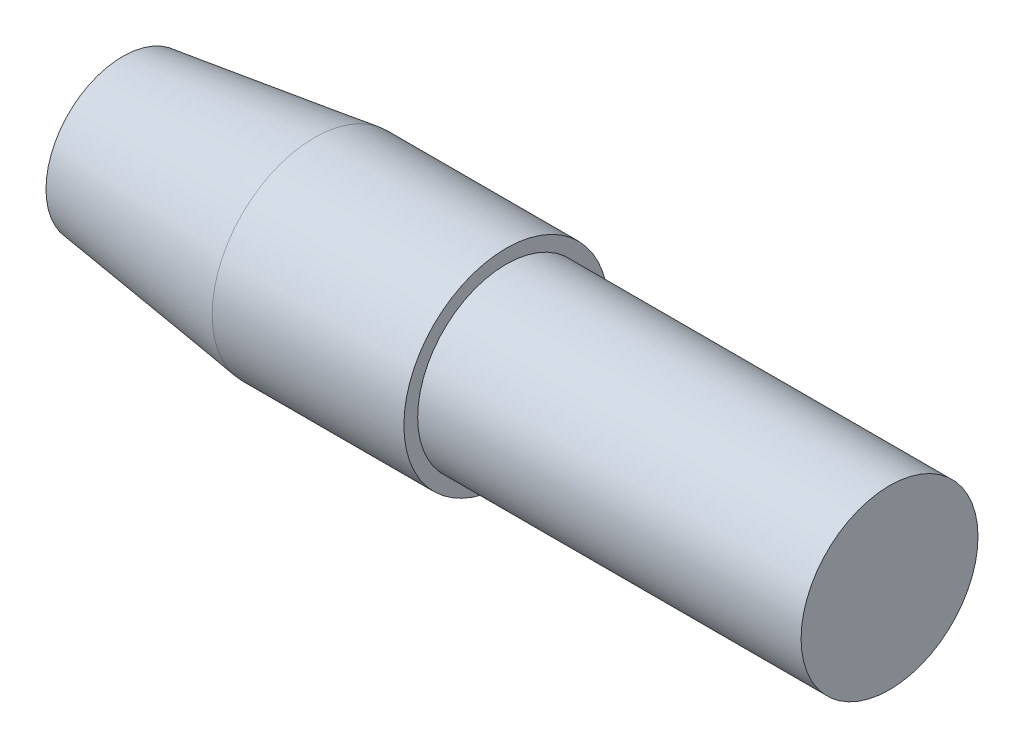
from build123d import *


with BuildPart() as part:
    # Skizze1 → Rotation1 (revolve)
    with BuildSketch(Plane.XY, mode=Mode.PRIVATE) as rotation1_sk:
        Polygon((0, 0), (30, 0), (30, 3.460463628), (15, 3.460463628), (15, 4), (7.5, 4), (0, 3), align=None)
    revolve(rotation1_sk.sketch.rotate(Axis((0, 0, 0), (1, 0, 0)), 90), axis=Axis((0, 0, 0), (1, 0, 0)))


solid = part.part
